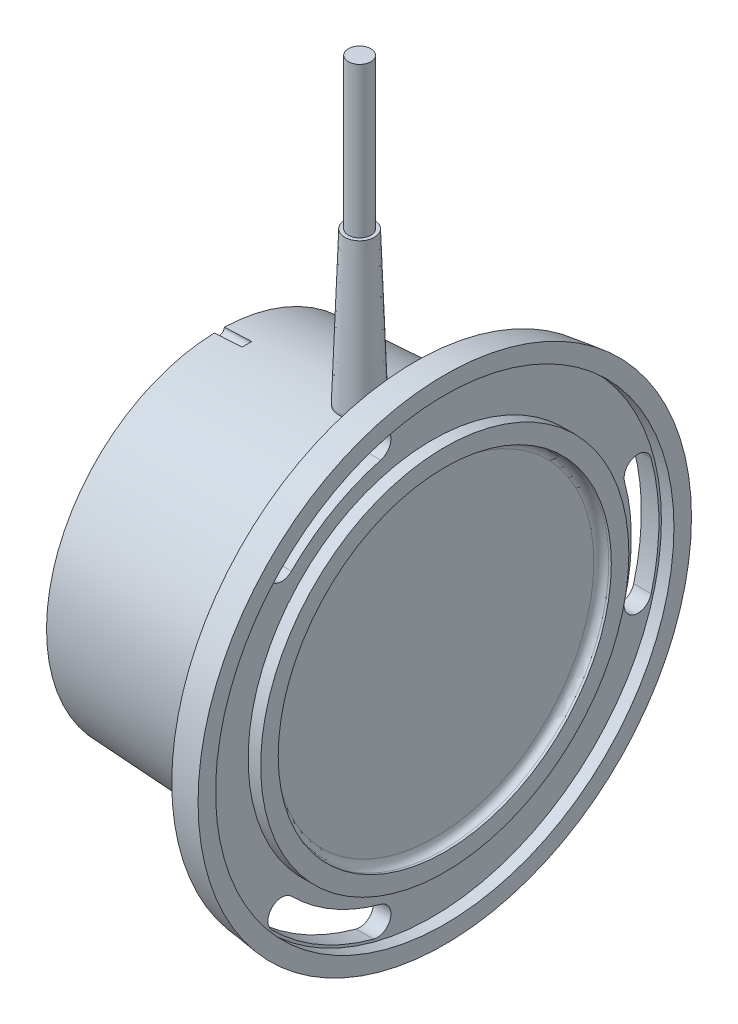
from build123d import *

# Parameters (mm, degrees)
ESQUISSE2_R                  = 1
ENL_V_MAT_EXTRU_1_DEPTH      = 5.5
ESQUISSE3_R                  = 4
EXTRUSION1_DEPTH             = 36
ESQUISSE4_R                  = 4
EXTRUSION2_DEPTH             = 30
EXTRUSION2_TAPER             = 2
ESQUISSE5_R                  = 2.25
EXTRUSION3_DEPTH             = 30
ENL_V_MAT_EXTRU_2_DEPTH      = 115.728211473
R_P_TITION_CIRCULAIRE1_COUNT = 3


with BuildPart() as part:
    # Esquisse1 → R_volution1 (revolve)
    with BuildSketch(Plane.XY, mode=Mode.PRIVATE) as r_volution1_sk:
        with BuildLine():
            Line((0, 0), (0, 34.5))
            Line((0, 34.5), (39, 36.5))
            Line((39, 36.5), (39, 48.5))
            Line((39, 48.5), (45, 49.25))
            Line((45, 49.25), (45, 45.75))
            Line((45, 45.75), (42.5, 45.75))
            Line((42.5, 45.75), (42.5, 36.75))
            Line((42.5, 36.75), (45, 36.75))
            Line((45, 36.75), (45, 33.25))
            Line((45, 33.25), (44.5, 33.25))
            ThreePointArc((44.5, 33.25), (43.439339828, 32.810660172), (43, 31.75))
            Line((43, 31.75), (43, 0))
            Line((43, 0), (0, 0))
        make_face()
    revolve(r_volution1_sk.sketch.rotate(Axis((104.922362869, 0, 0), (-1, 0, 0)), 90), axis=Axis((104.922362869, 0, 0), (-1, 0, 0)))

    # Esquisse2 → Enl_v. mat.-Extru.1 (cut)
    with BuildSketch(Plane.ZY):
        with Locations((0, 34.5)):
            Circle(ESQUISSE2_R)
    extrude(amount=-ENL_V_MAT_EXTRU_1_DEPTH, mode=Mode.SUBTRACT)

    # Esquisse3 → Extrusion1 (add)
    with BuildSketch(Plane(origin=(0, 0, 0), x_dir=(1, 0, 0), z_dir=(0, 1, 0))):
        with Locations((28, 0)):
            Circle(ESQUISSE3_R)
    extrude(amount=EXTRUSION1_DEPTH)

    # Esquisse4 → Extrusion2 (add)
    with BuildSketch(Plane(origin=(0, 36, 0), x_dir=(-1, 0, 0), z_dir=(0, 1, 0))):
        with Locations((-28, 0)):
            Circle(ESQUISSE4_R)
    extrude(amount=EXTRUSION2_DEPTH, taper=EXTRUSION2_TAPER)

    # Esquisse5 → Extrusion3 (add)
    with BuildSketch(Plane(origin=(0, 66, 0), x_dir=(-1, 0, 0), z_dir=(0, 1, 0))):
        with Locations(Location((-28, 0, 0), (0, 0, 90))):
            Circle(ESQUISSE5_R)
    extrude(amount=EXTRUSION3_DEPTH)

    # Esquisse6 → Enl_v. mat.-Extru.2 (cut, through all)
    with BuildSketch(Plane.ZY.offset(-39)):
        with BuildLine():
            ThreePointArc((-38.395503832, 10.288235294), (-40.340031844, 13.656292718), (-43.708089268, 11.711764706))
            ThreePointArc((-43.708089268, 11.711764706), (-45.25, 0), (-43.708089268, -11.711764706))
            ThreePointArc((-43.708089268, -11.711764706), (-40.340031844, -13.656292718), (-38.395503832, -10.288235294))
            ThreePointArc((-38.395503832, -10.288235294), (-39.75, 0), (-38.395503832, 10.288235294))
        make_face()
    enl_v_mat_extru_2 = extrude(amount=-ENL_V_MAT_EXTRU_2_DEPTH, mode=Mode.SUBTRACT)

    # R_p_tition circulaire1: Enl_v. mat.-Extru.2 ×3 about axis
    r_p_tition_circulaire1_axis = Axis((39, 0, 0), (-1, 0, 0))
    for i in range(1, R_P_TITION_CIRCULAIRE1_COUNT):
        add(enl_v_mat_extru_2.rotate(r_p_tition_circulaire1_axis, i * 360 / R_P_TITION_CIRCULAIRE1_COUNT), mode=Mode.SUBTRACT)


solid = part.part
